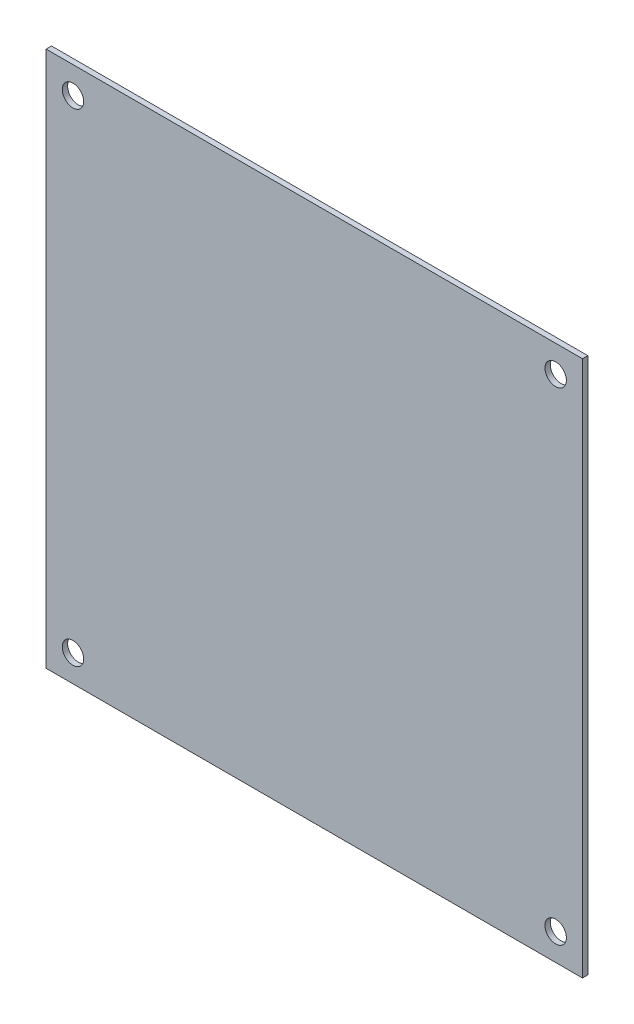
from build123d import *

# Parameters (mm, degrees)
SKETCH_1_W      = 500
SKETCH_1_H      = 500
SKETCH_1_R      = 10
EXTRUDE_1_DEPTH = 5


with BuildPart() as part:
    # Sketch 1 → Extrude 1 (new body)
    with BuildSketch(Plane.XY):
        Rectangle(SKETCH_1_W, SKETCH_1_H)
        with Locations((-225, 225)):
            Circle(SKETCH_1_R, mode=Mode.SUBTRACT)
        with Locations((225, 225)):
            Circle(SKETCH_1_R, mode=Mode.SUBTRACT)
        with Locations((225, -225)):
            Circle(SKETCH_1_R, mode=Mode.SUBTRACT)
        with Locations((-225, -225)):
            Circle(SKETCH_1_R, mode=Mode.SUBTRACT)
    extrude(amount=EXTRUDE_1_DEPTH)


solid = part.part
